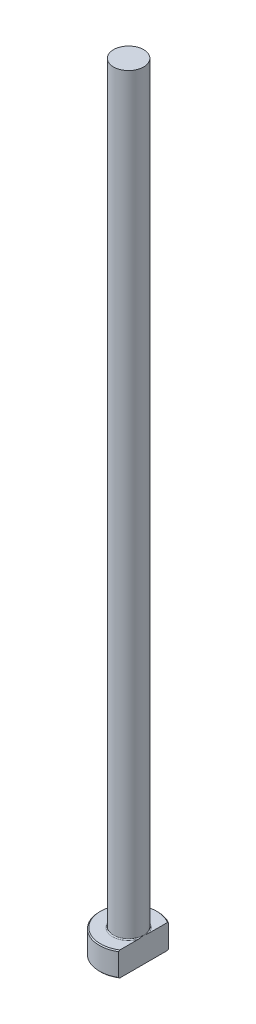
ISO-10303-21;
HEADER;
FILE_DESCRIPTION(('STEP AP214'),'2;1');
FILE_NAME('part.step','',(''),(''),'','','');
FILE_SCHEMA(('AUTOMOTIVE_DESIGN { 1 0 10303 214 1 1 1 1 }'));
ENDSEC;
DATA;
#1=APPLICATION_CONTEXT('core data for automotive mechanical design processes');
#2=APPLICATION_PROTOCOL_DEFINITION('international standard','automotive_design',2000,#1);
#3=PRODUCT_CONTEXT('',#1,'mechanical');
#4=PRODUCT('Part','Part','',(#3));
#5=PRODUCT_RELATED_PRODUCT_CATEGORY('part','',(#4));
#6=PRODUCT_DEFINITION_FORMATION('','',#4);
#7=PRODUCT_DEFINITION_CONTEXT('part definition',#1,'design');
#8=PRODUCT_DEFINITION('design','',#6,#7);
#9=PRODUCT_DEFINITION_SHAPE('','',#8);
#10=(LENGTH_UNIT() NAMED_UNIT(*) SI_UNIT(.MILLI.,.METRE.));
#11=(NAMED_UNIT(*) PLANE_ANGLE_UNIT() SI_UNIT($,.RADIAN.));
#12=(NAMED_UNIT(*) SI_UNIT($,.STERADIAN.) SOLID_ANGLE_UNIT());
#13=UNCERTAINTY_MEASURE_WITH_UNIT(LENGTH_MEASURE(1.E-05),#10,'distance_accuracy_value','');
#14=(GEOMETRIC_REPRESENTATION_CONTEXT(3) GLOBAL_UNCERTAINTY_ASSIGNED_CONTEXT((#13)) GLOBAL_UNIT_ASSIGNED_CONTEXT((#10,
#11,#12)) REPRESENTATION_CONTEXT('',''));
#15=CARTESIAN_POINT('',(0.,0.,0.));
#16=DIRECTION('',(0.,0.,1.));
#17=DIRECTION('',(1.,0.,0.));
#18=AXIS2_PLACEMENT_3D('',#15,#16,#17);
#19=CARTESIAN_POINT('',(0.,0.,0.));
#20=DIRECTION('',(0.,-1.,0.));
#21=DIRECTION('',(0.,0.,-1.));
#22=AXIS2_PLACEMENT_3D('',#19,#20,#21);
#23=PLANE('',#22);
#24=CARTESIAN_POINT('',(0.,0.,0.));
#25=DIRECTION('',(0.,-1.,0.));
#26=DIRECTION('',(0.,0.,-1.));
#27=AXIS2_PLACEMENT_3D('',#24,#25,#26);
#28=CIRCLE('',#27,5.79999999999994);
#29=CARTESIAN_POINT('',(3.09999999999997,0.,4.90204039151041));
#30=VERTEX_POINT('',#29);
#31=CARTESIAN_POINT('',(3.09999999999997,0.,-4.90204039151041));
#32=VERTEX_POINT('',#31);
#33=EDGE_CURVE('E98',#30,#32,#28,.T.);
#34=ORIENTED_EDGE('',*,*,#33,.T.);
#35=DIRECTION('',(0.,0.,1.));
#36=VECTOR('',#35,1.);
#37=CARTESIAN_POINT('',(3.09999999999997,0.,-5.13711981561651));
#38=LINE('',#37,#36);
#39=EDGE_CURVE('E83',#32,#30,#38,.T.);
#40=ORIENTED_EDGE('',*,*,#39,.T.);
#41=EDGE_LOOP('',(#34,#40));
#42=FACE_BOUND('',#41,.T.);
#43=ADVANCED_FACE('F32',(#42),#23,.T.);
#44=CARTESIAN_POINT('',(0.,259.958771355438,0.));
#45=DIRECTION('',(0.,1.,0.));
#46=DIRECTION('',(0.,0.,1.));
#47=AXIS2_PLACEMENT_3D('',#44,#45,#46);
#48=CYLINDRICAL_SURFACE('',#47,5.99999999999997);
#49=CARTESIAN_POINT('',(0.,4.80000000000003,0.));
#50=DIRECTION('',(0.,1.,0.));
#51=DIRECTION('',(0.,0.,1.));
#52=AXIS2_PLACEMENT_3D('',#49,#50,#51);
#53=CIRCLE('',#52,5.99999999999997);
#54=CARTESIAN_POINT('',(3.09999999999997,4.80000000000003,5.13711981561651));
#55=VERTEX_POINT('',#54);
#56=CARTESIAN_POINT('',(3.09999999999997,4.80000000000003,-5.13711981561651));
#57=VERTEX_POINT('',#56);
#58=EDGE_CURVE('E104',#55,#57,#53,.F.);
#59=ORIENTED_EDGE('',*,*,#58,.T.);
#60=DIRECTION('',(0.,-1.,0.));
#61=VECTOR('',#60,1.);
#62=CARTESIAN_POINT('',(3.09999999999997,160.,-5.13711981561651));
#63=LINE('',#62,#61);
#64=CARTESIAN_POINT('',(3.09999999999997,0.200000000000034,-5.13711981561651));
#65=VERTEX_POINT('',#64);
#66=EDGE_CURVE('E183',#57,#65,#63,.T.);
#67=ORIENTED_EDGE('',*,*,#66,.T.);
#68=CARTESIAN_POINT('',(0.,0.200000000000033,0.));
#69=DIRECTION('',(0.,-1.,0.));
#70=DIRECTION('',(0.,0.,-1.));
#71=AXIS2_PLACEMENT_3D('',#68,#69,#70);
#72=CIRCLE('',#71,5.99999999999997);
#73=CARTESIAN_POINT('',(3.09999999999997,0.200000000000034,5.13711981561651));
#74=VERTEX_POINT('',#73);
#75=EDGE_CURVE('E100',#65,#74,#72,.F.);
#76=ORIENTED_EDGE('',*,*,#75,.T.);
#77=DIRECTION('',(0.,-1.,0.));
#78=VECTOR('',#77,1.);
#79=CARTESIAN_POINT('',(3.09999999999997,160.,5.13711981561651));
#80=LINE('',#79,#78);
#81=EDGE_CURVE('E93',#55,#74,#80,.T.);
#82=ORIENTED_EDGE('',*,*,#81,.F.);
#83=EDGE_LOOP('',(#59,#67,#76,#82));
#84=FACE_BOUND('',#83,.T.);
#85=ADVANCED_FACE('F158',(#84),#48,.T.);
#86=CARTESIAN_POINT('',(-5.99999999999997,5.,0.));
#87=DIRECTION('',(0.,1.,0.));
#88=DIRECTION('',(0.,0.,1.));
#89=AXIS2_PLACEMENT_3D('',#86,#87,#88);
#90=PLANE('',#89);
#91=CARTESIAN_POINT('',(0.,5.,0.));
#92=DIRECTION('',(0.,1.,0.));
#93=DIRECTION('',(0.,0.,1.));
#94=AXIS2_PLACEMENT_3D('',#91,#92,#93);
#95=CIRCLE('',#94,5.79999999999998);
#96=CARTESIAN_POINT('',(3.09999999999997,5.,-4.90204039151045));
#97=VERTEX_POINT('',#96);
#98=CARTESIAN_POINT('',(3.09999999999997,5.,4.90204039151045));
#99=VERTEX_POINT('',#98);
#100=EDGE_CURVE('E178',#97,#99,#95,.T.);
#101=ORIENTED_EDGE('',*,*,#100,.T.);
#102=DIRECTION('',(0.,0.,-1.));
#103=VECTOR('',#102,1.);
#104=CARTESIAN_POINT('',(3.09999999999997,5.,0.));
#105=LINE('',#104,#103);
#106=CARTESIAN_POINT('',(3.09999999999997,4.99999999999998,1.13137084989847));
#107=VERTEX_POINT('',#106);
#108=EDGE_CURVE('E57',#99,#107,#105,.T.);
#109=ORIENTED_EDGE('',*,*,#108,.T.);
#110=CARTESIAN_POINT('',(0.,5.,0.));
#111=DIRECTION('',(0.,1.,0.));
#112=DIRECTION('',(0.,0.,1.));
#113=AXIS2_PLACEMENT_3D('',#110,#111,#112);
#114=CIRCLE('',#113,3.29999999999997);
#115=CARTESIAN_POINT('',(3.09999999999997,4.99999999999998,-1.13137084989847));
#116=VERTEX_POINT('',#115);
#117=EDGE_CURVE('E107',#107,#116,#114,.F.);
#118=ORIENTED_EDGE('',*,*,#117,.T.);
#119=EDGE_CURVE('E136',#116,#97,#105,.T.);
#120=ORIENTED_EDGE('',*,*,#119,.T.);
#121=EDGE_LOOP('',(#101,#109,#118,#120));
#122=FACE_BOUND('',#121,.T.);
#123=ADVANCED_FACE('F147',(#122),#90,.T.);
#124=CARTESIAN_POINT('',(0.,5.,0.));
#125=DIRECTION('',(0.,-1.,0.));
#126=DIRECTION('',(0.,0.,-1.));
#127=AXIS2_PLACEMENT_3D('',#124,#125,#126);
#128=CONICAL_SURFACE('',#127,5.79999999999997,0.785398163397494);
#129=ORIENTED_EDGE('',*,*,#58,.F.);
#130=CARTESIAN_POINT('',(3.09999999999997,-0.920431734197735,11.3030314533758));
#131=CARTESIAN_POINT('',(3.09999999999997,-0.688619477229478,11.0626468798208));
#132=CARTESIAN_POINT('',(3.09999999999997,-0.457063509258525,10.8220144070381));
#133=CARTESIAN_POINT('',(3.09999999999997,0.00539791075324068,10.3401205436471));
#134=CARTESIAN_POINT('',(3.09999999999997,0.236303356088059,10.0988591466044));
#135=CARTESIAN_POINT('',(3.09999999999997,0.69741098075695,9.61548494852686));
#136=CARTESIAN_POINT('',(3.09999999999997,0.927612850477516,9.3733718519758));
#137=CARTESIAN_POINT('',(3.09999999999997,1.38702344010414,8.88820676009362));
#138=CARTESIAN_POINT('',(3.09999999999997,1.61623216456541,8.64515476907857));
#139=CARTESIAN_POINT('',(3.09999999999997,2.06943803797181,8.16208218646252));
#140=CARTESIAN_POINT('',(3.09999999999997,2.29345676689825,7.92208185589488));
#141=CARTESIAN_POINT('',(3.09999999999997,2.73992554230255,7.4406269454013));
#142=CARTESIAN_POINT('',(3.09999999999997,2.96237559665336,7.19917237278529));
#143=CARTESIAN_POINT('',(3.09999999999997,3.40516728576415,6.71440911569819));
#144=CARTESIAN_POINT('',(3.09999999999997,3.6255092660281,6.47110074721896));
#145=CARTESIAN_POINT('',(3.09999999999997,4.06338097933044,5.98197014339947));
#146=CARTESIAN_POINT('',(3.09999999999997,4.28091078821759,5.736147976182));
#147=CARTESIAN_POINT('',(3.09999999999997,4.64723250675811,5.31542741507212));
#148=CARTESIAN_POINT('',(3.09999999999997,4.79703819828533,5.14141294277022));
#149=CARTESIAN_POINT('',(3.09999999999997,5.09412273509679,4.7912056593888));
#150=CARTESIAN_POINT('',(3.09999999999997,5.24140133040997,4.61501263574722));
#151=CARTESIAN_POINT('',(3.09999999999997,5.5340047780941,4.25808346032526));
#152=CARTESIAN_POINT('',(3.09999999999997,5.67929603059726,4.07731963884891));
#153=CARTESIAN_POINT('',(3.09999999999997,5.96506147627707,3.71208453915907));
#154=CARTESIAN_POINT('',(3.09999999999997,6.10553688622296,3.52761421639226));
#155=CARTESIAN_POINT('',(3.09999999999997,6.38162972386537,3.15098880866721));
#156=CARTESIAN_POINT('',(3.09999999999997,6.5171507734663,2.95876205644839));
#157=CARTESIAN_POINT('',(3.09999999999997,6.71260042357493,2.66498269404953));
#158=CARTESIAN_POINT('',(3.09999999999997,6.77649142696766,2.56607098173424));
#159=CARTESIAN_POINT('',(3.09999999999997,6.90093996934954,2.36617934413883));
#160=CARTESIAN_POINT('',(3.09999999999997,6.96149785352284,2.26519963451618));
#161=CARTESIAN_POINT('',(3.09999999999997,7.07778312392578,2.06197879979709));
#162=CARTESIAN_POINT('',(3.09999999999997,7.13355741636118,1.9597648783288));
#163=CARTESIAN_POINT('',(3.09999999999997,7.23993773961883,1.75269687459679));
#164=CARTESIAN_POINT('',(3.09999999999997,7.29054278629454,1.64784229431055));
#165=CARTESIAN_POINT('',(3.09999999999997,7.43232844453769,1.329374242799));
#166=CARTESIAN_POINT('',(3.09999999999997,7.51393038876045,1.11110705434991));
#167=CARTESIAN_POINT('',(3.09999999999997,7.60389052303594,0.78418122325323));
#168=CARTESIAN_POINT('',(3.09999999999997,7.62802295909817,0.679829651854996));
#169=CARTESIAN_POINT('',(3.09999999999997,7.66638713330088,0.46928482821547));
#170=CARTESIAN_POINT('',(3.09999999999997,7.68061997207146,0.363091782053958));
#171=CARTESIAN_POINT('',(3.09999999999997,7.69816738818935,0.150218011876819));
#172=CARTESIAN_POINT('',(3.09999999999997,7.70152516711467,0.0435409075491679));
#173=CARTESIAN_POINT('',(3.09999999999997,7.69719360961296,-0.169591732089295));
#174=CARTESIAN_POINT('',(3.09999999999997,7.68950359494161,-0.276047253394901));
#175=CARTESIAN_POINT('',(3.09999999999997,7.66373252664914,-0.486880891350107));
#176=CARTESIAN_POINT('',(3.09999999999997,7.64572733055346,-0.591268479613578));
#177=CARTESIAN_POINT('',(3.09999999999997,7.60052536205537,-0.798013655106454));
#178=CARTESIAN_POINT('',(3.09999999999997,7.57332729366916,-0.900370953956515));
#179=CARTESIAN_POINT('',(3.09999999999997,7.51094394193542,-1.10330613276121));
#180=CARTESIAN_POINT('',(3.09999999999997,7.47570859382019,-1.20386840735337));
#181=CARTESIAN_POINT('',(3.09999999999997,7.39875968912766,-1.40242722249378));
#182=CARTESIAN_POINT('',(3.09999999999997,7.35704736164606,-1.50042424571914));
#183=CARTESIAN_POINT('',(3.09999999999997,7.22811120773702,-1.78198575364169));
#184=CARTESIAN_POINT('',(3.09999999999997,7.13397777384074,-1.96237556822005));
#185=CARTESIAN_POINT('',(3.09999999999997,6.93309444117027,-2.31605883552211));
#186=CARTESIAN_POINT('',(3.09999999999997,6.82632930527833,-2.48934337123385));
#187=CARTESIAN_POINT('',(3.09999999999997,6.60386158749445,-2.83097436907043));
#188=CARTESIAN_POINT('',(3.09999999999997,6.48812633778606,-2.99929937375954));
#189=CARTESIAN_POINT('',(3.09999999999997,6.2507350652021,-3.33155975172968));
#190=CARTESIAN_POINT('',(3.09999999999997,6.12908188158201,-3.49549717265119));
#191=CARTESIAN_POINT('',(3.09999999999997,5.87989164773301,-3.82213838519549));
#192=CARTESIAN_POINT('',(3.09999999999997,5.75229938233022,-3.98479985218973));
#193=CARTESIAN_POINT('',(3.09999999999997,5.49383773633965,-4.30751445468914));
#194=CARTESIAN_POINT('',(3.09999999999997,5.36296802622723,-4.46756732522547));
#195=CARTESIAN_POINT('',(3.09999999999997,5.09906242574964,-4.78523580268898));
#196=CARTESIAN_POINT('',(3.09999999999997,4.96603235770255,-4.94285625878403));
#197=CARTESIAN_POINT('',(3.09999999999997,4.69805373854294,-5.25645943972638));
#198=CARTESIAN_POINT('',(3.09999999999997,4.56310515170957,-5.41244213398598));
#199=CARTESIAN_POINT('',(3.09999999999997,4.2080943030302,-5.81877937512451));
#200=CARTESIAN_POINT('',(3.09999999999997,3.98681570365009,-6.06807041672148));
#201=CARTESIAN_POINT('',(3.09999999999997,3.54147161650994,-6.56415415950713));
#202=CARTESIAN_POINT('',(3.09999999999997,3.31740605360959,-6.8109467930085));
#203=CARTESIAN_POINT('',(3.09999999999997,2.86701901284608,-7.30287446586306));
#204=CARTESIAN_POINT('',(3.09999999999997,2.64069567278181,-7.54800779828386));
#205=CARTESIAN_POINT('',(3.09999999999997,2.18649425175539,-8.0368296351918));
#206=CARTESIAN_POINT('',(3.09999999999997,1.95861616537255,-8.28051813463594));
#207=CARTESIAN_POINT('',(3.09999999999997,1.5108345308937,-8.75699429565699));
#208=CARTESIAN_POINT('',(3.09999999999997,1.29097841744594,-8.98982656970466));
#209=CARTESIAN_POINT('',(3.09999999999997,0.850379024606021,-9.4546514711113));
#210=CARTESIAN_POINT('',(3.09999999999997,0.629635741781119,-9.68664409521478));
#211=CARTESIAN_POINT('',(3.09999999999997,0.187673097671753,-10.1496925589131));
#212=CARTESIAN_POINT('',(3.09999999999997,-0.0335454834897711,-10.3807491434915));
#213=CARTESIAN_POINT('',(3.09999999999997,-0.476574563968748,-10.8422904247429));
#214=CARTESIAN_POINT('',(3.09999999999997,-0.698385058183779,-11.0727751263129));
#215=CARTESIAN_POINT('',(3.09999999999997,-0.920431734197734,-11.3030314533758));
#216=B_SPLINE_CURVE_WITH_KNOTS('',3,(#130,#131,#132,#133,#134,#135,#136,#137,#138,#139,#140,
#141,#142,#143,#144,#145,#146,#147,#148,#149,#150,#151,#152,#153,#154,#155,#156,#157,#158,#159,
#160,#161,#162,#163,#164,#165,#166,#167,#168,#169,#170,#171,#172,#173,#174,#175,#176,#177,#178,
#179,#180,#181,#182,#183,#184,#185,#186,#187,#188,#189,#190,#191,#192,#193,#194,#195,#196,#197,
#198,#199,#200,#201,#202,#203,#204,#205,#206,#207,#208,#209,#210,#211,#212,#213,#214,#215),
.UNSPECIFIED.,.F.,.F.,(4,2,2,2,2,2,2,2,2,2,2,2,2,2,2,2,2,2,2,2,2,2,2,2,2,2,2,2,2,2,2,2,2,2,2,2,
2,2,2,2,2,2,4),(0.,1.00184641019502,2.00370311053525,3.00595078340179,4.00819385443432,
4.9931053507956,5.97801190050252,6.9627541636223,7.94746981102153,8.6362949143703,
9.32518776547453,10.0208755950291,10.7163863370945,11.421700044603,11.7749044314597,
12.1280721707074,12.4772435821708,12.8264813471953,13.5223439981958,13.8432758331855,
14.1641719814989,14.4837917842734,14.8034312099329,15.1207496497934,15.4381128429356,
15.7575096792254,16.0768459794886,16.6863983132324,17.296693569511,17.9093265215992,
18.5216683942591,19.1418114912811,19.7620171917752,20.3807633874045,20.9995211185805,
21.9994842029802,22.9994743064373,24.0003716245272,25.0012724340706,25.961961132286,
26.9226535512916,27.882299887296,28.8419379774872),.UNSPECIFIED.);
#217=EDGE_CURVE('E135',#55,#99,#216,.T.);
#218=ORIENTED_EDGE('',*,*,#217,.T.);
#219=ORIENTED_EDGE('',*,*,#100,.F.);
#220=EDGE_CURVE('E127',#97,#57,#216,.T.);
#221=ORIENTED_EDGE('',*,*,#220,.T.);
#222=EDGE_LOOP('',(#129,#218,#219,#221));
#223=FACE_BOUND('',#222,.T.);
#224=ADVANCED_FACE('F143',(#223),#128,.T.);
#225=CARTESIAN_POINT('',(0.,0.200000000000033,0.));
#226=DIRECTION('',(0.,1.,0.));
#227=DIRECTION('',(0.,0.,1.));
#228=AXIS2_PLACEMENT_3D('',#225,#226,#227);
#229=CONICAL_SURFACE('',#228,5.99999999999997,0.785398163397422);
#230=ORIENTED_EDGE('',*,*,#75,.F.);
#231=CARTESIAN_POINT('',(3.09999999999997,5.92043173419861,-11.3030314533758));
#232=CARTESIAN_POINT('',(3.09999999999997,5.68861947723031,-11.0626468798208));
#233=CARTESIAN_POINT('',(3.09999999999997,5.4570635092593,-10.822014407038));
#234=CARTESIAN_POINT('',(3.09999999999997,4.99460208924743,-10.340120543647));
#235=CARTESIAN_POINT('',(3.09999999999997,4.76369664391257,-10.0988591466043));
#236=CARTESIAN_POINT('',(3.09999999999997,4.30258901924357,-9.61548494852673));
#237=CARTESIAN_POINT('',(3.09999999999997,4.07238714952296,-9.37337185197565));
#238=CARTESIAN_POINT('',(3.09999999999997,3.61297655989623,-8.88820676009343));
#239=CARTESIAN_POINT('',(3.09999999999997,3.38376783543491,-8.64515476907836));
#240=CARTESIAN_POINT('',(3.09999999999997,2.93056196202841,-8.16208218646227));
#241=CARTESIAN_POINT('',(3.09999999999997,2.70654323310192,-7.92208185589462));
#242=CARTESIAN_POINT('',(3.09999999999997,2.26007445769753,-7.44062694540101));
#243=CARTESIAN_POINT('',(3.09999999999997,2.03762440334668,-7.19917237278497));
#244=CARTESIAN_POINT('',(3.09999999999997,1.59483271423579,-6.71440911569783));
#245=CARTESIAN_POINT('',(3.09999999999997,1.3744907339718,-6.47110074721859));
#246=CARTESIAN_POINT('',(3.09999999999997,0.936619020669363,-5.98197014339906));
#247=CARTESIAN_POINT('',(3.09999999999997,0.71908921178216,-5.73614797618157));
#248=CARTESIAN_POINT('',(3.09999999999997,0.352767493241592,-5.31542741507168));
#249=CARTESIAN_POINT('',(3.09999999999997,0.202961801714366,-5.1414129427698));
#250=CARTESIAN_POINT('',(3.09999999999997,-0.094122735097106,-4.7912056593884));
#251=CARTESIAN_POINT('',(3.09999999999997,-0.241401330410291,-4.61501263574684));
#252=CARTESIAN_POINT('',(3.09999999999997,-0.534004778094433,-4.25808346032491));
#253=CARTESIAN_POINT('',(3.09999999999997,-0.679296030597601,-4.07731963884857));
#254=CARTESIAN_POINT('',(3.09999999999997,-0.965061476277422,-3.71208453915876));
#255=CARTESIAN_POINT('',(3.09999999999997,-1.10553688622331,-3.52761421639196));
#256=CARTESIAN_POINT('',(3.09999999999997,-1.38162972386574,-3.15098880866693));
#257=CARTESIAN_POINT('',(3.09999999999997,-1.51715077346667,-2.95876205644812));
#258=CARTESIAN_POINT('',(3.09999999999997,-1.71260042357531,-2.66498269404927));
#259=CARTESIAN_POINT('',(3.09999999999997,-1.77649142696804,-2.56607098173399));
#260=CARTESIAN_POINT('',(3.09999999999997,-1.90093996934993,-2.36617934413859));
#261=CARTESIAN_POINT('',(3.09999999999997,-1.96149785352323,-2.26519963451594));
#262=CARTESIAN_POINT('',(3.09999999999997,-2.07778312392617,-2.06197879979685));
#263=CARTESIAN_POINT('',(3.09999999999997,-2.13355741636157,-1.95976487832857));
#264=CARTESIAN_POINT('',(3.09999999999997,-2.23993773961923,-1.75269687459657));
#265=CARTESIAN_POINT('',(3.09999999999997,-2.29054278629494,-1.64784229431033));
#266=CARTESIAN_POINT('',(3.09999999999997,-2.43232844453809,-1.3293742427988));
#267=CARTESIAN_POINT('',(3.09999999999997,-2.51393038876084,-1.11110705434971));
#268=CARTESIAN_POINT('',(3.09999999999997,-2.60389052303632,-0.784181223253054));
#269=CARTESIAN_POINT('',(3.09999999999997,-2.62802295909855,-0.679829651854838));
#270=CARTESIAN_POINT('',(3.09999999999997,-2.66638713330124,-0.46928482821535));
#271=CARTESIAN_POINT('',(3.09999999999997,-2.68061997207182,-0.363091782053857));
#272=CARTESIAN_POINT('',(3.09999999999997,-2.69816738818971,-0.150218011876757));
#273=CARTESIAN_POINT('',(3.09999999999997,-2.70152516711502,-0.0435409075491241));
#274=CARTESIAN_POINT('',(3.09999999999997,-2.69719360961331,0.1695917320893));
#275=CARTESIAN_POINT('',(3.09999999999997,-2.68950359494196,0.276047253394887));
#276=CARTESIAN_POINT('',(3.09999999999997,-2.6637325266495,0.486880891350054));
#277=CARTESIAN_POINT('',(3.09999999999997,-2.64572733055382,0.591268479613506));
#278=CARTESIAN_POINT('',(3.09999999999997,-2.60052536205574,0.798013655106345));
#279=CARTESIAN_POINT('',(3.09999999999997,-2.57332729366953,0.900370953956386));
#280=CARTESIAN_POINT('',(3.09999999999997,-2.51094394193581,1.10330613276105));
#281=CARTESIAN_POINT('',(3.09999999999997,-2.47570859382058,1.20386840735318));
#282=CARTESIAN_POINT('',(3.09999999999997,-2.39875968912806,1.40242722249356));
#283=CARTESIAN_POINT('',(3.09999999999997,-2.35704736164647,1.5004242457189));
#284=CARTESIAN_POINT('',(3.09999999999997,-2.22811120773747,1.78198575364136));
#285=CARTESIAN_POINT('',(3.09999999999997,-2.13397777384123,1.96237556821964));
#286=CARTESIAN_POINT('',(3.09999999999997,-1.93309444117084,2.31605883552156));
#287=CARTESIAN_POINT('',(3.09999999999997,-1.82632930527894,2.48934337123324));
#288=CARTESIAN_POINT('',(3.09999999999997,-1.60386158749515,2.83097436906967));
#289=CARTESIAN_POINT('',(3.09999999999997,-1.48812633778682,2.99929937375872));
#290=CARTESIAN_POINT('',(3.09999999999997,-1.25073506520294,3.33155975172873));
#291=CARTESIAN_POINT('',(3.09999999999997,-1.1290818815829,3.49549717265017));
#292=CARTESIAN_POINT('',(3.09999999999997,-0.879891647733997,3.82213838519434));
#293=CARTESIAN_POINT('',(3.09999999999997,-0.752299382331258,3.98479985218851));
#294=CARTESIAN_POINT('',(3.09999999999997,-0.493837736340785,4.30751445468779));
#295=CARTESIAN_POINT('',(3.09999999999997,-0.362968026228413,4.46756732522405));
#296=CARTESIAN_POINT('',(3.09999999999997,-0.0990624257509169,4.78523580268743));
#297=CARTESIAN_POINT('',(3.09999999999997,0.033967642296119,4.94285625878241));
#298=CARTESIAN_POINT('',(3.09999999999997,0.301946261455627,5.25645943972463));
#299=CARTESIAN_POINT('',(3.09999999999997,0.436894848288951,5.41244213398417));
#300=CARTESIAN_POINT('',(3.09999999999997,0.791905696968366,5.81877937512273));
#301=CARTESIAN_POINT('',(3.09999999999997,1.01318429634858,6.06807041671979));
#302=CARTESIAN_POINT('',(3.09999999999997,1.45852838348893,6.56415415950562));
#303=CARTESIAN_POINT('',(3.09999999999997,1.68259394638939,6.81094679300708));
#304=CARTESIAN_POINT('',(3.09999999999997,2.13298098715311,7.30287446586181));
#305=CARTESIAN_POINT('',(3.09999999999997,2.35930432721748,7.54800779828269));
#306=CARTESIAN_POINT('',(3.09999999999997,2.81350574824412,8.03682963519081));
#307=CARTESIAN_POINT('',(3.09999999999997,3.04138383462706,8.28051813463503));
#308=CARTESIAN_POINT('',(3.09999999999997,3.48916546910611,8.75699429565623));
#309=CARTESIAN_POINT('',(3.09999999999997,3.70902158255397,8.98982656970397));
#310=CARTESIAN_POINT('',(3.09999999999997,4.14962097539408,9.45465147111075));
#311=CARTESIAN_POINT('',(3.09999999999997,4.37036425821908,9.6866440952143));
#312=CARTESIAN_POINT('',(3.09999999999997,4.81232690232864,10.1496925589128));
#313=CARTESIAN_POINT('',(3.09999999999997,5.03354548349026,10.3807491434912));
#314=CARTESIAN_POINT('',(3.09999999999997,5.47657456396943,10.8422904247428));
#315=CARTESIAN_POINT('',(3.09999999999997,5.69838505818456,11.0727751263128));
#316=CARTESIAN_POINT('',(3.09999999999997,5.92043173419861,11.3030314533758));
#317=B_SPLINE_CURVE_WITH_KNOTS('',3,(#231,#232,#233,#234,#235,#236,#237,#238,#239,#240,#241,
#242,#243,#244,#245,#246,#247,#248,#249,#250,#251,#252,#253,#254,#255,#256,#257,#258,#259,#260,
#261,#262,#263,#264,#265,#266,#267,#268,#269,#270,#271,#272,#273,#274,#275,#276,#277,#278,#279,
#280,#281,#282,#283,#284,#285,#286,#287,#288,#289,#290,#291,#292,#293,#294,#295,#296,#297,#298,
#299,#300,#301,#302,#303,#304,#305,#306,#307,#308,#309,#310,#311,#312,#313,#314,#315,#316),
.UNSPECIFIED.,.F.,.F.,(4,2,2,2,2,2,2,2,2,2,2,2,2,2,2,2,2,2,2,2,2,2,2,2,2,2,2,2,2,2,2,2,2,2,2,2,
2,2,2,2,2,2,4),(0.,1.00184641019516,2.00370311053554,3.00595078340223,4.00819385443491,
4.99310535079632,5.97801190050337,6.96275416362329,7.94746981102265,8.6362949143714,
9.32518776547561,10.0208755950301,10.7163863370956,11.421700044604,11.7749044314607,
12.1280721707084,12.4772435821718,12.8264813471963,13.5223439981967,13.8432758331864,
14.1641719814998,14.4837917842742,14.8034312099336,15.1207496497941,15.4381128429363,
15.757509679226,16.0768459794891,16.6863983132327,17.2966935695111,17.909326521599,
18.5216683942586,19.1418114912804,19.7620171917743,20.3807633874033,20.999521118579,
21.9994842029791,22.9994743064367,24.000371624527,25.0012724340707,25.9619611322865,
26.9226535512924,27.8822998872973,28.8419379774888),.UNSPECIFIED.);
#318=EDGE_CURVE('E86',#65,#32,#317,.T.);
#319=ORIENTED_EDGE('',*,*,#318,.T.);
#320=ORIENTED_EDGE('',*,*,#33,.F.);
#321=EDGE_CURVE('E89',#30,#74,#317,.T.);
#322=ORIENTED_EDGE('',*,*,#321,.T.);
#323=EDGE_LOOP('',(#230,#319,#320,#322));
#324=FACE_BOUND('',#323,.T.);
#325=ADVANCED_FACE('F97',(#324),#229,.T.);
#326=CARTESIAN_POINT('',(0.,5.19999999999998,0.));
#327=DIRECTION('',(0.,1.,0.));
#328=DIRECTION('',(0.,0.,1.));
#329=AXIS2_PLACEMENT_3D('',#326,#327,#328);
#330=TOROIDAL_SURFACE('',#329,3.29999999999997,0.2);
#331=CARTESIAN_POINT('',(3.09999999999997,5.19999999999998,0.));
#332=CARTESIAN_POINT('',(3.09999999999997,5.20000050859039,8.63470448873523E-11));
#333=CARTESIAN_POINT('',(3.09999999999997,5.20000101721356,-1.96831350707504E-07));
#334=CARTESIAN_POINT('',(3.09999999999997,5.20000196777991,-7.43387548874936E-07));
#335=CARTESIAN_POINT('',(3.09999999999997,5.20000239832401,-1.10608751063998E-06));
#336=CARTESIAN_POINT('',(3.09999999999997,5.20000329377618,-1.97482885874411E-06));
#337=CARTESIAN_POINT('',(3.09999999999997,5.20000374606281,-2.49491365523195E-06));
#338=CARTESIAN_POINT('',(3.09999999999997,5.20000455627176,-3.57320004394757E-06));
#339=CARTESIAN_POINT('',(3.09999999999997,5.20000491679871,-4.12959627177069E-06));
#340=CARTESIAN_POINT('',(3.09999999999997,5.20000625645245,-6.28443543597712E-06));
#341=CARTESIAN_POINT('',(3.09999999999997,5.20000716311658,-7.93057681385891E-06));
#342=CARTESIAN_POINT('',(3.09999999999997,5.20000865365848,-1.11908861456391E-05));
#343=CARTESIAN_POINT('',(3.09999999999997,5.20000925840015,-1.27959111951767E-05));
#344=CARTESIAN_POINT('',(3.09999999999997,5.20001179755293,-1.95895744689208E-05));
#345=CARTESIAN_POINT('',(3.09999999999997,5.20001369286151,-2.47960258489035E-05));
#346=CARTESIAN_POINT('',(3.09999999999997,5.20001648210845,-3.46313916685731E-05));
#347=CARTESIAN_POINT('',(3.09999999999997,5.20001748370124,-3.9229578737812E-05));
#348=CARTESIAN_POINT('',(3.09999999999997,5.20002478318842,-7.34062169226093E-05));
#349=CARTESIAN_POINT('',(3.09999999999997,5.20003031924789,-0.000103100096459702));
#350=CARTESIAN_POINT('',(3.09999999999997,5.20005455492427,-0.000220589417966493));
#351=CARTESIAN_POINT('',(3.09999999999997,5.2000776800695,-0.000307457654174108));
#352=CARTESIAN_POINT('',(3.09999999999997,5.20016786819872,-0.000651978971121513));
#353=CARTESIAN_POINT('',(3.09999999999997,5.20023206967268,-0.000910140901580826));
#354=CARTESIAN_POINT('',(3.09999999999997,5.2004894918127,-0.00193760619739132));
#355=CARTESIAN_POINT('',(3.09999999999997,5.20068632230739,-0.00270624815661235));
#356=CARTESIAN_POINT('',(3.09999999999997,5.20150547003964,-0.00591366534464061));
#357=CARTESIAN_POINT('',(3.09999999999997,5.20212323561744,-0.00835327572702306));
#358=CARTESIAN_POINT('',(3.09999999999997,5.2072994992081,-0.0287840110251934));
#359=CARTESIAN_POINT('',(3.09999999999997,5.21187465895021,-0.046772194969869));
#360=CARTESIAN_POINT('',(3.09999999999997,5.22081406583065,-0.0820386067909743));
#361=CARTESIAN_POINT('',(3.09999999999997,5.22517945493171,-0.0993165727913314));
#362=CARTESIAN_POINT('',(3.09999999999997,5.23938711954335,-0.155760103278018));
#363=CARTESIAN_POINT('',(3.09999999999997,5.24916620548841,-0.19494192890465));
#364=CARTESIAN_POINT('',(3.09999999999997,5.26559812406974,-0.262010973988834));
#365=CARTESIAN_POINT('',(3.09999999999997,5.27233495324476,-0.289877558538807));
#366=CARTESIAN_POINT('',(3.09999999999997,5.28539894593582,-0.344925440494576));
#367=CARTESIAN_POINT('',(3.09999999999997,5.2917322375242,-0.372105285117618));
#368=CARTESIAN_POINT('',(3.09999999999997,5.3104657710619,-0.454441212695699));
#369=CARTESIAN_POINT('',(3.09999999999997,5.32242624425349,-0.509699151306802));
#370=CARTESIAN_POINT('',(3.09999999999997,5.34470875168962,-0.621095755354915));
#371=CARTESIAN_POINT('',(3.09999999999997,5.35501420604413,-0.677237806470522));
#372=CARTESIAN_POINT('',(3.09999999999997,5.37397233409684,-0.795308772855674));
#373=CARTESIAN_POINT('',(3.09999999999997,5.38237372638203,-0.857279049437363));
#374=CARTESIAN_POINT('',(3.09999999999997,5.39483964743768,-0.981488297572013));
#375=CARTESIAN_POINT('',(3.09999999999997,5.39891956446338,-1.04372551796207));
#376=CARTESIAN_POINT('',(3.09999999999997,5.4002522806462,-1.1364625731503));
#377=CARTESIAN_POINT('',(3.09999999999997,5.39992868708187,-1.16692514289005));
#378=CARTESIAN_POINT('',(3.09999999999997,5.39736890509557,-1.22783403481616));
#379=CARTESIAN_POINT('',(3.09999999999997,5.39512949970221,-1.25828024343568));
#380=CARTESIAN_POINT('',(3.09999999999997,5.3882758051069,-1.31816284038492));
#381=CARTESIAN_POINT('',(3.09999999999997,5.38372059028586,-1.34760578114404));
#382=CARTESIAN_POINT('',(3.09999999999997,5.37149785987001,-1.40581436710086));
#383=CARTESIAN_POINT('',(3.09999999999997,5.36383981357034,-1.43458179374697));
#384=CARTESIAN_POINT('',(3.09999999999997,5.34913051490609,-1.47610977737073));
#385=CARTESIAN_POINT('',(3.09999999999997,5.34380195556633,-1.48947638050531));
#386=CARTESIAN_POINT('',(3.09999999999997,5.33179609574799,-1.51565425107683));
#387=CARTESIAN_POINT('',(3.09999999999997,5.32511527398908,-1.52846396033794));
#388=CARTESIAN_POINT('',(3.09999999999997,5.31156812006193,-1.55058530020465));
#389=CARTESIAN_POINT('',(3.09999999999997,5.30500876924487,-1.56008264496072));
#390=CARTESIAN_POINT('',(3.09999999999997,5.29056237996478,-1.5780097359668));
#391=CARTESIAN_POINT('',(3.09999999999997,5.28267975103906,-1.58644287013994));
#392=CARTESIAN_POINT('',(3.09999999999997,5.26899499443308,-1.59836257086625));
#393=CARTESIAN_POINT('',(3.09999999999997,5.26370979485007,-1.60243897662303));
#394=CARTESIAN_POINT('',(3.09999999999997,5.25259769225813,-1.60977856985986));
#395=CARTESIAN_POINT('',(3.09999999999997,5.24677147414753,-1.61304276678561));
#396=CARTESIAN_POINT('',(3.09999999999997,5.23558966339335,-1.61807105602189));
#397=CARTESIAN_POINT('',(3.09999999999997,5.23030479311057,-1.61999055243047));
#398=CARTESIAN_POINT('',(3.09999999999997,5.21948724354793,-1.62291762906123));
#399=CARTESIAN_POINT('',(3.09999999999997,5.21395478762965,-1.62392601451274));
#400=CARTESIAN_POINT('',(3.09999999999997,5.20277366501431,-1.62493544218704));
#401=CARTESIAN_POINT('',(3.09999999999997,5.19712461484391,-1.62493233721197));
#402=CARTESIAN_POINT('',(3.09999999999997,5.18591949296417,-1.62390846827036));
#403=CARTESIAN_POINT('',(3.09999999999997,5.1803634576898,-1.62288731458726));
#404=CARTESIAN_POINT('',(3.09999999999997,5.16982009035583,-1.62001450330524));
#405=CARTESIAN_POINT('',(3.09999999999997,5.16481843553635,-1.61821408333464));
#406=CARTESIAN_POINT('',(3.09999999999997,5.15512149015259,-1.61392929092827));
#407=CARTESIAN_POINT('',(3.09999999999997,5.15042629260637,-1.61144471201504));
#408=CARTESIAN_POINT('',(3.09999999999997,5.13843536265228,-1.60413057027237));
#409=CARTESIAN_POINT('',(3.09999999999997,5.13143004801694,-1.59882575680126));
#410=CARTESIAN_POINT('',(3.09999999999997,5.11831643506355,-1.5871999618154));
#411=CARTESIAN_POINT('',(3.09999999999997,5.1122112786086,-1.58087557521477));
#412=CARTESIAN_POINT('',(3.09999999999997,5.09648912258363,-1.56251896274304));
#413=CARTESIAN_POINT('',(3.09999999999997,5.08770172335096,-1.54978301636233));
#414=CARTESIAN_POINT('',(3.09999999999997,5.07201622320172,-1.52323986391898));
#415=CARTESIAN_POINT('',(3.09999999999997,5.06512028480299,-1.50943145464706));
#416=CARTESIAN_POINT('',(3.09999999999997,5.05247518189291,-1.48047677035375));
#417=CARTESIAN_POINT('',(3.09999999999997,5.04680124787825,-1.46529814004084));
#418=CARTESIAN_POINT('',(3.09999999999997,5.03672275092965,-1.43451819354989));
#419=CARTESIAN_POINT('',(3.09999999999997,5.03231964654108,-1.41891641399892));
#420=CARTESIAN_POINT('',(3.09999999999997,5.02058030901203,-1.37142005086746));
#421=CARTESIAN_POINT('',(3.09999999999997,5.01483238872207,-1.3391366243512));
#422=CARTESIAN_POINT('',(3.09999999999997,5.00376797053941,-1.25503165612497));
#423=CARTESIAN_POINT('',(3.09999999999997,5.00071471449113,-1.20294070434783));
#424=CARTESIAN_POINT('',(3.09999999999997,4.99950954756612,-1.09856941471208));
#425=CARTESIAN_POINT('',(3.09999999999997,5.00137734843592,-1.04628915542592));
#426=CARTESIAN_POINT('',(3.09999999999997,5.00844280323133,-0.944923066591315));
#427=CARTESIAN_POINT('',(3.09999999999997,5.01344756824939,-0.895822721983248));
#428=CARTESIAN_POINT('',(3.09999999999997,5.02575896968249,-0.798308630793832));
#429=CARTESIAN_POINT('',(3.09999999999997,5.03304750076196,-0.749892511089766));
#430=CARTESIAN_POINT('',(3.09999999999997,5.04953811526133,-0.652335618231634));
#431=CARTESIAN_POINT('',(3.09999999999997,5.05877753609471,-0.603201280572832));
#432=CARTESIAN_POINT('',(3.09999999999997,5.07884455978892,-0.503941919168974));
#433=CARTESIAN_POINT('',(3.09999999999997,5.08970698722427,-0.453824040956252));
#434=CARTESIAN_POINT('',(3.09999999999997,5.10895219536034,-0.369008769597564));
#435=CARTESIAN_POINT('',(3.09999999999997,5.11708529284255,-0.334253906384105));
#436=CARTESIAN_POINT('',(3.09999999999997,5.13360118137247,-0.265211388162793));
#437=CARTESIAN_POINT('',(3.09999999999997,5.14198019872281,-0.230922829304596));
#438=CARTESIAN_POINT('',(3.09999999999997,5.15798158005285,-0.16629806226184));
#439=CARTESIAN_POINT('',(3.09999999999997,5.16558151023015,-0.135956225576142));
#440=CARTESIAN_POINT('',(3.09999999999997,5.1812139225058,-0.0740081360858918));
#441=CARTESIAN_POINT('',(3.09999999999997,5.18925105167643,-0.0424030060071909));
#442=CARTESIAN_POINT('',(3.09999999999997,5.19787768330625,-0.0083493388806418));
#443=CARTESIAN_POINT('',(3.09999999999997,5.1984965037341,-0.00590581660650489));
#444=CARTESIAN_POINT('',(3.09999999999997,5.19931589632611,-0.00269751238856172));
#445=CARTESIAN_POINT('',(3.09999999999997,5.19951194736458,-0.00193190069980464));
#446=CARTESIAN_POINT('',(3.09999999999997,5.1997684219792,-0.000908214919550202));
#447=CARTESIAN_POINT('',(3.09999999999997,5.19983243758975,-0.000650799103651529));
#448=CARTESIAN_POINT('',(3.09999999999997,5.19992240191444,-0.00030714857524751));
#449=CARTESIAN_POINT('',(3.09999999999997,5.19994549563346,-0.000220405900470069));
#450=CARTESIAN_POINT('',(3.09999999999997,5.19996970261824,-0.000103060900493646));
#451=CARTESIAN_POINT('',(3.09999999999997,5.19997523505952,-7.33845004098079E-05));
#452=CARTESIAN_POINT('',(3.09999999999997,5.19998252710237,-3.92257131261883E-05));
#453=CARTESIAN_POINT('',(3.09999999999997,5.19998352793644,-3.462848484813E-05));
#454=CARTESIAN_POINT('',(3.09999999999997,5.1999863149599,-2.4795096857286E-05));
#455=CARTESIAN_POINT('',(3.09999999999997,5.19998820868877,-1.95896135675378E-05));
#456=CARTESIAN_POINT('',(3.09999999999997,5.19999074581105,-1.2796958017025E-05));
#457=CARTESIAN_POINT('',(3.09999999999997,5.1999913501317,-1.11920046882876E-05));
#458=CARTESIAN_POINT('',(3.09999999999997,5.19999283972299,-7.93177065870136E-06));
#459=CARTESIAN_POINT('',(3.09999999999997,5.19999374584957,-6.28562370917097E-06));
#460=CARTESIAN_POINT('',(3.09999999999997,5.19999508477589,-4.13069797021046E-06));
#461=CARTESIAN_POINT('',(3.09999999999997,5.1999954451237,-3.57425625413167E-06));
#462=CARTESIAN_POINT('',(3.09999999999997,5.19999625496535,-2.49584654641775E-06));
#463=CARTESIAN_POINT('',(3.09999999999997,5.19999670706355,-1.97568269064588E-06));
#464=CARTESIAN_POINT('',(3.09999999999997,5.19999760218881,-1.10675611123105E-06));
#465=CARTESIAN_POINT('',(3.09999999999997,5.19999803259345,-7.4395710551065E-07));
#466=CARTESIAN_POINT('',(3.09999999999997,5.19999898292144,-1.97149804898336E-07));
#467=CARTESIAN_POINT('',(3.09999999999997,5.19999949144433,-8.63411446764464E-11));
#468=CARTESIAN_POINT('',(3.09999999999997,5.19999999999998,0.));
#469=B_SPLINE_CURVE_WITH_KNOTS('',3,(#331,#332,#333,#334,#335,#336,#337,#338,#339,#340,#341,
#342,#343,#344,#345,#346,#347,#348,#349,#350,#351,#352,#353,#354,#355,#356,#357,#358,#359,#360,
#361,#362,#363,#364,#365,#366,#367,#368,#369,#370,#371,#372,#373,#374,#375,#376,#377,#378,#379,
#380,#381,#382,#383,#384,#385,#386,#387,#388,#389,#390,#391,#392,#393,#394,#395,#396,#397,#398,
#399,#400,#401,#402,#403,#404,#405,#406,#407,#408,#409,#410,#411,#412,#413,#414,#415,#416,#417,
#418,#419,#420,#421,#422,#423,#424,#425,#426,#427,#428,#429,#430,#431,#432,#433,#434,#435,#436,
#437,#438,#439,#440,#441,#442,#443,#444,#445,#446,#447,#448,#449,#450,#451,#452,#453,#454,#455,
#456,#457,#458,#459,#460,#461,#462,#463,#464,#465,#466,#467,#468),.UNSPECIFIED.,.T.,.F.,(4,2,2,
2,2,2,2,2,2,2,2,2,2,2,2,2,2,2,2,2,2,2,2,2,2,2,2,2,2,2,2,2,2,2,2,2,2,2,2,2,2,2,2,2,2,2,2,2,2,2,2,
2,2,2,2,2,2,2,2,2,2,2,2,2,2,2,2,2,4),(0.,1.53981331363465E-06,3.23033975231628E-06,
5.28553578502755E-06,7.27344647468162E-06,1.28910817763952E-05,1.8031960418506E-05,
3.46255039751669E-05,4.8726433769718E-05,0.000139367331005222,0.000408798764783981,
0.0012071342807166,0.00358714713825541,0.0111373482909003,0.0668184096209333,0.120281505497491,
0.241431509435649,0.327438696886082,0.411161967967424,0.580755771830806,0.751954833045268,
0.939477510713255,1.12633017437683,1.21767988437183,1.30918328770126,1.39846159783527,
1.48746947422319,1.53058836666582,1.57382101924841,1.60836719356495,1.64280045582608,
1.66276990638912,1.68271441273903,1.69951299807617,1.71629672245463,1.73314926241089,
1.75000825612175,1.76589594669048,1.78178843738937,1.80799762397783,1.83429622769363,
1.88045465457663,1.9266656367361,1.97520355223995,2.02379695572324,2.12194851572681,
2.27811623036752,2.43491043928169,2.58289937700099,2.7297435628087,2.87970504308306,
3.03353547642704,3.14061512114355,3.24650617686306,3.34034416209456,3.4381742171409,
3.44573655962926,3.44810718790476,3.44890321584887,3.44917225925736,3.44926284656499,
3.44927694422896,3.44929353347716,3.44929867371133,3.44930429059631,3.44930627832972,
3.44930833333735,3.44931002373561,3.4493115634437),.UNSPECIFIED.);
#470=CARTESIAN_POINT('',(3.09999999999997,5.19999999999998,0.));
#471=VERTEX_POINT('',#470);
#472=EDGE_CURVE('E11',#116,#471,#469,.T.);
#473=ORIENTED_EDGE('',*,*,#472,.F.);
#474=ORIENTED_EDGE('',*,*,#117,.F.);
#475=CARTESIAN_POINT('',(3.09999999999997,5.19999999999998,0.));
#476=CARTESIAN_POINT('',(3.09999999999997,5.19999949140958,-8.63470557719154E-11));
#477=CARTESIAN_POINT('',(3.09999999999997,5.19999898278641,1.96831350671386E-07));
#478=CARTESIAN_POINT('',(3.09999999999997,5.19999803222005,7.43387548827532E-07));
#479=CARTESIAN_POINT('',(3.09999999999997,5.19999760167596,1.10608751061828E-06));
#480=CARTESIAN_POINT('',(3.09999999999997,5.19999670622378,1.97482885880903E-06));
#481=CARTESIAN_POINT('',(3.09999999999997,5.19999625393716,2.49491365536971E-06));
#482=CARTESIAN_POINT('',(3.09999999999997,5.1999954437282,3.57320004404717E-06));
#483=CARTESIAN_POINT('',(3.09999999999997,5.19999508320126,4.12959627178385E-06));
#484=CARTESIAN_POINT('',(3.09999999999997,5.19999374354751,6.28443543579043E-06));
#485=CARTESIAN_POINT('',(3.09999999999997,5.19999283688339,7.93057681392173E-06));
#486=CARTESIAN_POINT('',(3.09999999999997,5.19999134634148,1.1190886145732E-05));
#487=CARTESIAN_POINT('',(3.09999999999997,5.19999074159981,1.27959111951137E-05));
#488=CARTESIAN_POINT('',(3.09999999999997,5.19998820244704,1.95895744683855E-05));
#489=CARTESIAN_POINT('',(3.09999999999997,5.19998630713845,2.47960258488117E-05));
#490=CARTESIAN_POINT('',(3.09999999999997,5.19998351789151,3.4631391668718E-05));
#491=CARTESIAN_POINT('',(3.09999999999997,5.19998251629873,3.9229578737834E-05));
#492=CARTESIAN_POINT('',(3.09999999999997,5.19997521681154,7.34062169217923E-05));
#493=CARTESIAN_POINT('',(3.09999999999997,5.19996968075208,0.000103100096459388));
#494=CARTESIAN_POINT('',(3.09999999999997,5.1999454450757,0.000220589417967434));
#495=CARTESIAN_POINT('',(3.09999999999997,5.19992231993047,0.000307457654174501));
#496=CARTESIAN_POINT('',(3.09999999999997,5.19983213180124,0.000651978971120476));
#497=CARTESIAN_POINT('',(3.09999999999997,5.19976793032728,0.00091014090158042));
#498=CARTESIAN_POINT('',(3.09999999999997,5.19951050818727,0.00193760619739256));
#499=CARTESIAN_POINT('',(3.09999999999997,5.19931367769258,0.00270624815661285));
#500=CARTESIAN_POINT('',(3.09999999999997,5.19849452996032,0.00591366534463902));
#501=CARTESIAN_POINT('',(3.09999999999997,5.19787676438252,0.00835327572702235));
#502=CARTESIAN_POINT('',(3.09999999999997,5.19270050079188,0.0287840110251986));
#503=CARTESIAN_POINT('',(3.09999999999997,5.18812534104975,0.0467721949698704));
#504=CARTESIAN_POINT('',(3.09999999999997,5.17918593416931,0.0820386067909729));
#505=CARTESIAN_POINT('',(3.09999999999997,5.17482054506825,0.0993165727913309));
#506=CARTESIAN_POINT('',(3.09999999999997,5.16061288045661,0.15576010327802));
#507=CARTESIAN_POINT('',(3.09999999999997,5.15083379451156,0.194941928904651));
#508=CARTESIAN_POINT('',(3.09999999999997,5.13440187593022,0.262010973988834));
#509=CARTESIAN_POINT('',(3.09999999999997,5.12766504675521,0.289877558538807));
#510=CARTESIAN_POINT('',(3.09999999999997,5.11460105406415,0.344925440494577));
#511=CARTESIAN_POINT('',(3.09999999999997,5.10826776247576,0.372105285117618));
#512=CARTESIAN_POINT('',(3.09999999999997,5.08953422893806,0.454441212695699));
#513=CARTESIAN_POINT('',(3.09999999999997,5.07757375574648,0.509699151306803));
#514=CARTESIAN_POINT('',(3.09999999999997,5.05529124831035,0.621095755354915));
#515=CARTESIAN_POINT('',(3.09999999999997,5.04498579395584,0.677237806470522));
#516=CARTESIAN_POINT('',(3.09999999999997,5.02602766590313,0.795308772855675));
#517=CARTESIAN_POINT('',(3.09999999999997,5.01762627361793,0.857279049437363));
#518=CARTESIAN_POINT('',(3.09999999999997,5.00516035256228,0.981488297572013));
#519=CARTESIAN_POINT('',(3.09999999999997,5.00108043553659,1.04372551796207));
#520=CARTESIAN_POINT('',(3.09999999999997,4.99974771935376,1.1364625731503));
#521=CARTESIAN_POINT('',(3.09999999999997,5.0000713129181,1.16692514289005));
#522=CARTESIAN_POINT('',(3.09999999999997,5.00263109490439,1.22783403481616));
#523=CARTESIAN_POINT('',(3.09999999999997,5.00487050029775,1.25828024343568));
#524=CARTESIAN_POINT('',(3.09999999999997,5.01172419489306,1.31816284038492));
#525=CARTESIAN_POINT('',(3.09999999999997,5.0162794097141,1.34760578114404));
#526=CARTESIAN_POINT('',(3.09999999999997,5.02850214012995,1.40581436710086));
#527=CARTESIAN_POINT('',(3.09999999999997,5.03616018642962,1.43458179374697));
#528=CARTESIAN_POINT('',(3.09999999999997,5.05086948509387,1.47610977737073));
#529=CARTESIAN_POINT('',(3.09999999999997,5.05619804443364,1.48947638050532));
#530=CARTESIAN_POINT('',(3.09999999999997,5.06820390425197,1.51565425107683));
#531=CARTESIAN_POINT('',(3.09999999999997,5.07488472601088,1.52846396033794));
#532=CARTESIAN_POINT('',(3.09999999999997,5.08843187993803,1.55058530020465));
#533=CARTESIAN_POINT('',(3.09999999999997,5.0949912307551,1.56008264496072));
#534=CARTESIAN_POINT('',(3.09999999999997,5.10943762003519,1.5780097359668));
#535=CARTESIAN_POINT('',(3.09999999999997,5.11732024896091,1.58644287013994));
#536=CARTESIAN_POINT('',(3.09999999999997,5.13100500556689,1.59836257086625));
#537=CARTESIAN_POINT('',(3.09999999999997,5.1362902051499,1.60243897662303));
#538=CARTESIAN_POINT('',(3.09999999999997,5.14740230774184,1.60977856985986));
#539=CARTESIAN_POINT('',(3.09999999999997,5.15322852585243,1.61304276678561));
#540=CARTESIAN_POINT('',(3.09999999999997,5.16441033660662,1.61807105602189));
#541=CARTESIAN_POINT('',(3.09999999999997,5.16969520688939,1.61999055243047));
#542=CARTESIAN_POINT('',(3.09999999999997,5.18051275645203,1.62291762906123));
#543=CARTESIAN_POINT('',(3.09999999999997,5.18604521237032,1.62392601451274));
#544=CARTESIAN_POINT('',(3.09999999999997,5.19722633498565,1.62493544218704));
#545=CARTESIAN_POINT('',(3.09999999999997,5.20287538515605,1.62493233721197));
#546=CARTESIAN_POINT('',(3.09999999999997,5.21408050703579,1.62390846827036));
#547=CARTESIAN_POINT('',(3.09999999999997,5.21963654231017,1.62288731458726));
#548=CARTESIAN_POINT('',(3.09999999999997,5.23017990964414,1.62001450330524));
#549=CARTESIAN_POINT('',(3.09999999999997,5.23518156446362,1.61821408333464));
#550=CARTESIAN_POINT('',(3.09999999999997,5.24487850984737,1.61392929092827));
#551=CARTESIAN_POINT('',(3.09999999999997,5.2495737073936,1.61144471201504));
#552=CARTESIAN_POINT('',(3.09999999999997,5.26156463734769,1.60413057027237));
#553=CARTESIAN_POINT('',(3.09999999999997,5.26856995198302,1.59882575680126));
#554=CARTESIAN_POINT('',(3.09999999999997,5.28168356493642,1.5871999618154));
#555=CARTESIAN_POINT('',(3.09999999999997,5.28778872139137,1.58087557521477));
#556=CARTESIAN_POINT('',(3.09999999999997,5.30351087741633,1.56251896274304));
#557=CARTESIAN_POINT('',(3.09999999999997,5.312298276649,1.54978301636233));
#558=CARTESIAN_POINT('',(3.09999999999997,5.32798377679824,1.52323986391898));
#559=CARTESIAN_POINT('',(3.09999999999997,5.33487971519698,1.50943145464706));
#560=CARTESIAN_POINT('',(3.09999999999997,5.34752481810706,1.48047677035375));
#561=CARTESIAN_POINT('',(3.09999999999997,5.35319875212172,1.46529814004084));
#562=CARTESIAN_POINT('',(3.09999999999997,5.36327724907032,1.43451819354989));
#563=CARTESIAN_POINT('',(3.09999999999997,5.36768035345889,1.41891641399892));
#564=CARTESIAN_POINT('',(3.09999999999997,5.37941969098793,1.37142005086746));
#565=CARTESIAN_POINT('',(3.09999999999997,5.3851676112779,1.33913662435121));
#566=CARTESIAN_POINT('',(3.09999999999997,5.39623202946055,1.25503165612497));
#567=CARTESIAN_POINT('',(3.09999999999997,5.39928528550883,1.20294070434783));
#568=CARTESIAN_POINT('',(3.09999999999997,5.40049045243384,1.09856941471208));
#569=CARTESIAN_POINT('',(3.09999999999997,5.39862265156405,1.04628915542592));
#570=CARTESIAN_POINT('',(3.09999999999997,5.39155719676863,0.944923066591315));
#571=CARTESIAN_POINT('',(3.09999999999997,5.38655243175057,0.895822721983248));
#572=CARTESIAN_POINT('',(3.09999999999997,5.37424103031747,0.798308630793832));
#573=CARTESIAN_POINT('',(3.09999999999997,5.36695249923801,0.749892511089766));
#574=CARTESIAN_POINT('',(3.09999999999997,5.35046188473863,0.652335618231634));
#575=CARTESIAN_POINT('',(3.09999999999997,5.34122246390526,0.603201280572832));
#576=CARTESIAN_POINT('',(3.09999999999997,5.32115544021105,0.503941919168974));
#577=CARTESIAN_POINT('',(3.09999999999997,5.3102930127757,0.453824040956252));
#578=CARTESIAN_POINT('',(3.09999999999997,5.29104780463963,0.369008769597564));
#579=CARTESIAN_POINT('',(3.09999999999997,5.28291470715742,0.334253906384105));
#580=CARTESIAN_POINT('',(3.09999999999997,5.2663988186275,0.265211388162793));
#581=CARTESIAN_POINT('',(3.09999999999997,5.25801980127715,0.230922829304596));
#582=CARTESIAN_POINT('',(3.09999999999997,5.24201841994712,0.16629806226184));
#583=CARTESIAN_POINT('',(3.09999999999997,5.23441848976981,0.135956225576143));
#584=CARTESIAN_POINT('',(3.09999999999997,5.21878607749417,0.0740081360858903));
#585=CARTESIAN_POINT('',(3.09999999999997,5.21074894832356,0.0424030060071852));
#586=CARTESIAN_POINT('',(3.09999999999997,5.20212231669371,0.00834933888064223));
#587=CARTESIAN_POINT('',(3.09999999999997,5.20150349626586,0.00590581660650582));
#588=CARTESIAN_POINT('',(3.09999999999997,5.20068410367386,0.0026975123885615));
#589=CARTESIAN_POINT('',(3.09999999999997,5.20048805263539,0.00193190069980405));
#590=CARTESIAN_POINT('',(3.09999999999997,5.20023157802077,0.000908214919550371));
#591=CARTESIAN_POINT('',(3.09999999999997,5.20016756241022,0.000650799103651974));
#592=CARTESIAN_POINT('',(3.09999999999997,5.20007759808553,0.000307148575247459));
#593=CARTESIAN_POINT('',(3.09999999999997,5.20005450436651,0.000220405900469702));
#594=CARTESIAN_POINT('',(3.09999999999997,5.20003029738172,0.000103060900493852));
#595=CARTESIAN_POINT('',(3.09999999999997,5.20002476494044,7.33845004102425E-05));
#596=CARTESIAN_POINT('',(3.09999999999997,5.20001747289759,3.92257131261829E-05));
#597=CARTESIAN_POINT('',(3.09999999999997,5.20001647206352,3.46284848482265E-05));
#598=CARTESIAN_POINT('',(3.09999999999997,5.20001368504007,2.47950968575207E-05));
#599=CARTESIAN_POINT('',(3.09999999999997,5.20001179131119,1.95896135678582E-05));
#600=CARTESIAN_POINT('',(3.09999999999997,5.20000925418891,1.27969580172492E-05));
#601=CARTESIAN_POINT('',(3.09999999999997,5.20000864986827,1.11920046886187E-05));
#602=CARTESIAN_POINT('',(3.09999999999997,5.20000716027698,7.93177065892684E-06));
#603=CARTESIAN_POINT('',(3.09999999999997,5.20000625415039,6.28562370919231E-06));
#604=CARTESIAN_POINT('',(3.09999999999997,5.20000491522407,4.13069797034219E-06));
#605=CARTESIAN_POINT('',(3.09999999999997,5.20000455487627,3.57425625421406E-06));
#606=CARTESIAN_POINT('',(3.09999999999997,5.20000374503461,2.4958465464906E-06));
#607=CARTESIAN_POINT('',(3.09999999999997,5.20000329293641,1.97568269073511E-06));
#608=CARTESIAN_POINT('',(3.09999999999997,5.20000239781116,1.10675611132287E-06));
#609=CARTESIAN_POINT('',(3.09999999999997,5.20000196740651,7.43957105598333E-07));
#610=CARTESIAN_POINT('',(3.09999999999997,5.20000101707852,1.97149804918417E-07));
#611=CARTESIAN_POINT('',(3.09999999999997,5.20000050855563,8.63411555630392E-11));
#612=CARTESIAN_POINT('',(3.09999999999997,5.19999999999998,0.));
#613=B_SPLINE_CURVE_WITH_KNOTS('',3,(#475,#476,#477,#478,#479,#480,#481,#482,#483,#484,#485,
#486,#487,#488,#489,#490,#491,#492,#493,#494,#495,#496,#497,#498,#499,#500,#501,#502,#503,#504,
#505,#506,#507,#508,#509,#510,#511,#512,#513,#514,#515,#516,#517,#518,#519,#520,#521,#522,#523,
#524,#525,#526,#527,#528,#529,#530,#531,#532,#533,#534,#535,#536,#537,#538,#539,#540,#541,#542,
#543,#544,#545,#546,#547,#548,#549,#550,#551,#552,#553,#554,#555,#556,#557,#558,#559,#560,#561,
#562,#563,#564,#565,#566,#567,#568,#569,#570,#571,#572,#573,#574,#575,#576,#577,#578,#579,#580,
#581,#582,#583,#584,#585,#586,#587,#588,#589,#590,#591,#592,#593,#594,#595,#596,#597,#598,#599,
#600,#601,#602,#603,#604,#605,#606,#607,#608,#609,#610,#611,#612),.UNSPECIFIED.,.T.,.F.,(4,2,2,
2,2,2,2,2,2,2,2,2,2,2,2,2,2,2,2,2,2,2,2,2,2,2,2,2,2,2,2,2,2,2,2,2,2,2,2,2,2,2,2,2,2,2,2,2,2,2,2,
2,2,2,2,2,2,2,2,2,2,2,2,2,2,2,2,2,4),(0.,1.53981331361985E-06,3.23033975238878E-06,
5.28553578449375E-06,7.27344647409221E-06,1.28910817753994E-05,1.80319604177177E-05,
3.4625503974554E-05,4.87264337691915E-05,0.000139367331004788,0.000408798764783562,
0.00120713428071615,0.00358714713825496,0.0111373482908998,0.0668184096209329,0.120281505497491,
0.241431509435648,0.327438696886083,0.411161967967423,0.580755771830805,0.751954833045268,
0.939477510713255,1.12633017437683,1.21767988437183,1.30918328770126,1.39846159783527,
1.48746947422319,1.53058836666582,1.57382101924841,1.60836719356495,1.64280045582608,
1.66276990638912,1.68271441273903,1.69951299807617,1.71629672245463,1.73314926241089,
1.75000825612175,1.76589594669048,1.78178843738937,1.80799762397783,1.83429622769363,
1.88045465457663,1.9266656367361,1.97520355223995,2.02379695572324,2.12194851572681,
2.27811623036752,2.43491043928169,2.582899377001,2.7297435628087,2.87970504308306,
3.03353547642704,3.14061512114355,3.24650617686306,3.34034416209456,3.4381742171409,
3.44573655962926,3.44810718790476,3.44890321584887,3.44917225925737,3.44926284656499,
3.44927694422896,3.44929353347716,3.44929867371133,3.44930429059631,3.44930627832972,
3.44930833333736,3.44931002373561,3.4493115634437),.UNSPECIFIED.);
#614=EDGE_CURVE('E46',#471,#107,#613,.T.);
#615=ORIENTED_EDGE('',*,*,#614,.F.);
#616=CARTESIAN_POINT('',(0.,5.19999999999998,0.));
#617=DIRECTION('',(0.,1.,0.));
#618=DIRECTION('',(0.,0.,1.));
#619=AXIS2_PLACEMENT_3D('',#616,#617,#618);
#620=CIRCLE('',#619,3.09999999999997);
#621=EDGE_CURVE('E103',#471,#471,#620,.T.);
#622=ORIENTED_EDGE('',*,*,#621,.F.);
#623=EDGE_LOOP('',(#473,#474,#615,#622));
#624=FACE_BOUND('',#623,.T.);
#625=ADVANCED_FACE('F34',(#624),#330,.F.);
#626=CARTESIAN_POINT('',(0.,259.958771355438,0.));
#627=DIRECTION('',(0.,1.,0.));
#628=DIRECTION('',(0.,0.,1.));
#629=AXIS2_PLACEMENT_3D('',#626,#627,#628);
#630=CYLINDRICAL_SURFACE('',#629,3.09999999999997);
#631=ORIENTED_EDGE('',*,*,#621,.T.);
#632=EDGE_LOOP('',(#631));
#633=FACE_BOUND('',#632,.T.);
#634=CARTESIAN_POINT('',(0.,160.,0.));
#635=DIRECTION('',(0.,1.,0.));
#636=DIRECTION('',(0.,0.,1.));
#637=AXIS2_PLACEMENT_3D('',#634,#635,#636);
#638=CIRCLE('',#637,3.09999999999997);
#639=CARTESIAN_POINT('',(0.,160.,3.09999999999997));
#640=VERTEX_POINT('',#639);
#641=EDGE_CURVE('E101',#640,#640,#638,.T.);
#642=ORIENTED_EDGE('',*,*,#641,.F.);
#643=EDGE_LOOP('',(#642));
#644=FACE_BOUND('',#643,.T.);
#645=ADVANCED_FACE('F155',(#633,#644),#630,.T.);
#646=CARTESIAN_POINT('',(-3.09999999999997,160.,0.));
#647=DIRECTION('',(0.,1.,0.));
#648=DIRECTION('',(0.,0.,1.));
#649=AXIS2_PLACEMENT_3D('',#646,#647,#648);
#650=PLANE('',#649);
#651=ORIENTED_EDGE('',*,*,#641,.T.);
#652=EDGE_LOOP('',(#651));
#653=FACE_BOUND('',#652,.T.);
#654=ADVANCED_FACE('F121',(#653),#650,.T.);
#655=CARTESIAN_POINT('',(3.09999999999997,160.,-5.13711981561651));
#656=DIRECTION('',(1.,0.,0.));
#657=DIRECTION('',(0.,0.,-1.));
#658=AXIS2_PLACEMENT_3D('',#655,#656,#657);
#659=PLANE('',#658);
#660=ORIENTED_EDGE('',*,*,#66,.F.);
#661=ORIENTED_EDGE('',*,*,#220,.F.);
#662=ORIENTED_EDGE('',*,*,#119,.F.);
#663=ORIENTED_EDGE('',*,*,#472,.T.);
#664=ORIENTED_EDGE('',*,*,#614,.T.);
#665=ORIENTED_EDGE('',*,*,#108,.F.);
#666=ORIENTED_EDGE('',*,*,#217,.F.);
#667=ORIENTED_EDGE('',*,*,#81,.T.);
#668=ORIENTED_EDGE('',*,*,#321,.F.);
#669=ORIENTED_EDGE('',*,*,#39,.F.);
#670=ORIENTED_EDGE('',*,*,#318,.F.);
#671=EDGE_LOOP('',(#660,#661,#662,#663,#664,#665,#666,#667,#668,#669,#670));
#672=FACE_BOUND('',#671,.T.);
#673=ADVANCED_FACE('F85',(#672),#659,.T.);
#674=CLOSED_SHELL('',(#43,#85,#123,#224,#325,#625,#645,#654,#673));
#675=MANIFOLD_SOLID_BREP('B2',#674);
#676=ADVANCED_BREP_SHAPE_REPRESENTATION('',(#18,#675),#14);
#677=SHAPE_DEFINITION_REPRESENTATION(#9,#676);
ENDSEC;
END-ISO-10303-21;
